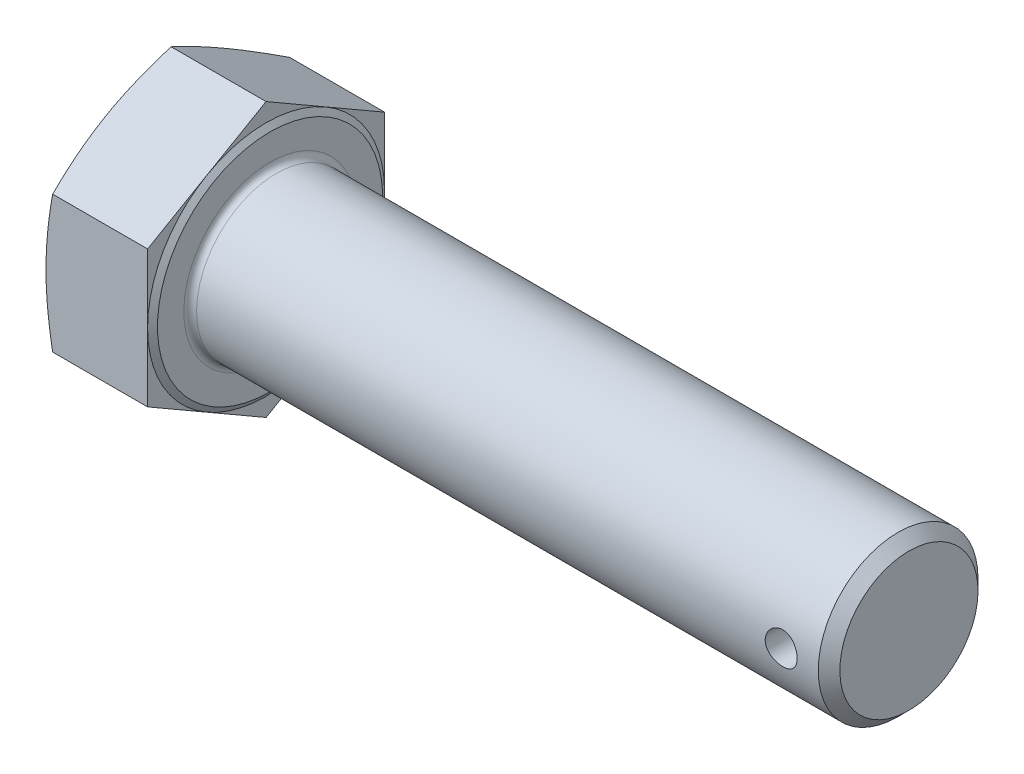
from build123d import *

# Parameters (mm, degrees)
BASEHEAD_DEPTH  = 12.72
SKETCH3_R       = 10
BASEBODY_DEPTH  = 80
CHAMFER1_SIZE   = 1.353
HEADFILLET_R    = 0.8
HOLE_DEPTH      = 96.934779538
HOLE_DEPTH_BACK = 96.934779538
SKETCH5_R       = 2


with BuildPart() as part:
    # Sketch-BaseHead → BaseHead (new body)
    with BuildSketch(Plane(origin=(0, 0, 0), x_dir=(0, 0, -1), z_dir=(1, 0, 0))):
        Polygon((0, -17.129982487), (14.835, -8.564991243), (14.835, 8.564991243), (0, 17.129982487), (-14.835, 8.564991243), (-14.835, -8.564991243), align=None)
    extrude(amount=BASEHEAD_DEPTH)

    # Sketch4 → HeadChamfer (revolve, cut)
    with BuildSketch(Plane(origin=(-0.264637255, -5.916896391, 0), x_dir=(0, 1, 0), z_dir=(0, 0, 1))):
        Polygon((23.046878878, -0.264637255), (20.751896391, -0.264637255), (23.046878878, -1.099942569), align=None)
    revolve(axis=Axis((-4.001564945, 0, 0), (1, 0, 0)), mode=Mode.SUBTRACT)

    # Sketch1 → Revolve1 (revolve)
    with BuildSketch(Plane(origin=(0, 0, 0), x_dir=(1, 0, 0), z_dir=(0, 1, 0)), mode=Mode.PRIVATE) as revolve1_sk:
        Polygon((12.72, 0), (13.22, 0), (13.22, 14.095), (12.72, 14.835), align=None)
    revolve(revolve1_sk.sketch.rotate(Axis((-4.001564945, 0, 0), (1, 0, 0)), 270), axis=Axis((-4.001564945, 0, 0), (1, 0, 0)))

    # Sketch3 → BaseBody (add)
    with BuildSketch(Plane(origin=(13.22, 0, 0), x_dir=(0, 0, -1), z_dir=(1, 0, 0))):
        with Locations(Location((0, 0, 0), (0, 0, 270))):
            Circle(SKETCH3_R)
    extrude(amount=BASEBODY_DEPTH)

    # Chamfer1
    chamfer1_edges = [part.edges().sort_by_distance(p)[0] for p in [
        (93.22, 10, 0),
    ]]
    chamfer(chamfer1_edges, length=CHAMFER1_SIZE)

    # HeadFillet
    headfillet_edges = [part.edges().sort_by_distance(p)[0] for p in [
        (13.22, 10, 0),
    ]]
    fillet(headfillet_edges, radius=HEADFILLET_R)

    # Sketch5 → Hole (cut, two sides: drawn at the far end of the back side and taken through both)
    with BuildSketch(Plane.XY.offset(-HOLE_DEPTH_BACK)):
        with Locations((87.22, 0)):
            Circle(SKETCH5_R)
    extrude(amount=HOLE_DEPTH + HOLE_DEPTH_BACK, mode=Mode.SUBTRACT)


solid = part.part
